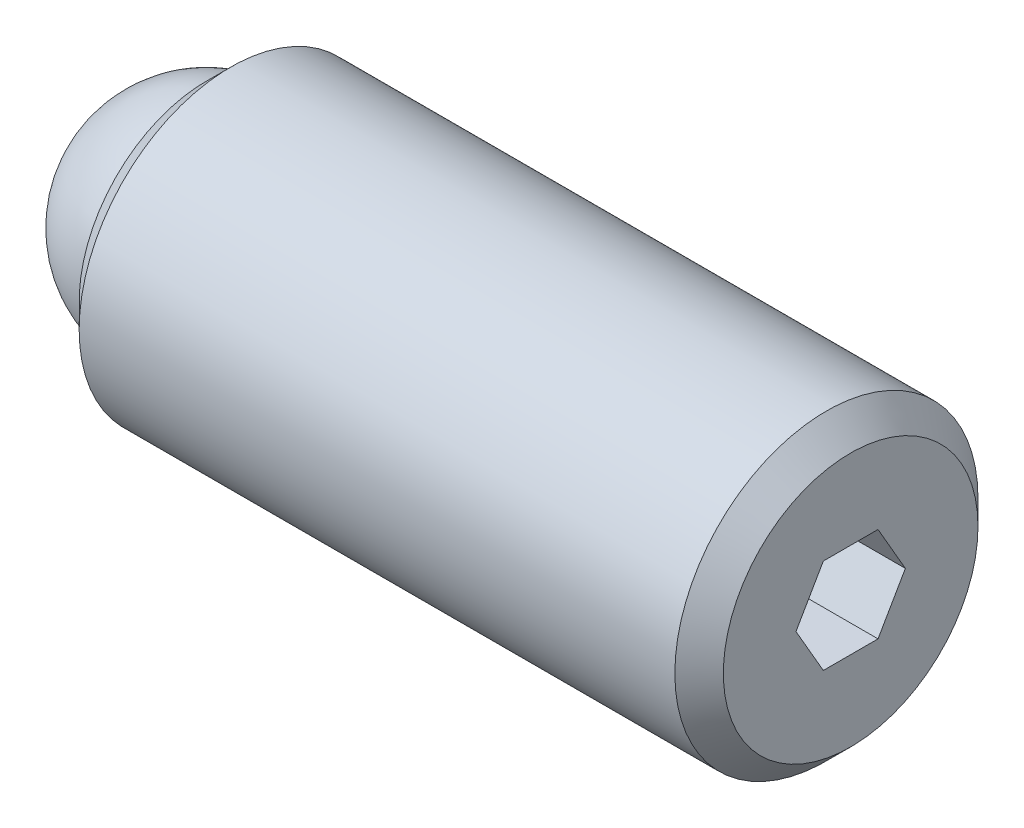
from build123d import *

# Parameters (mm, degrees)
SKETCH2_R           = 3.175
BOSS_EXTRUDE1_DEPTH = 13.49375
CHAMFER1_SIZE       = 0.508
CHAMFER2_SIZE       = 0.508
CUT_EXTRUDE2_DEPTH  = 2.286
SKETCH3_R           = 2.38125
CUT_EXTRUDE3_DEPTH  = 1.984375


with BuildPart() as part:
    # Sketch2 → Boss-Extrude1 (new body)
    with BuildSketch(Plane(origin=(0, 0, 0), x_dir=(0, 0, -1), z_dir=(1, 0, 0))):
        Circle(SKETCH2_R)
    extrude(amount=BOSS_EXTRUDE1_DEPTH)

    # Chamfer1
    chamfer1_edges = [part.edges().sort_by_distance(p)[0] for p in [
        (0, 0, 3.175),
    ]]
    chamfer(chamfer1_edges, length=CHAMFER1_SIZE)

    # Chamfer2
    chamfer2_edges = [part.edges().sort_by_distance(p)[0] for p in [
        (13.49375, 0, 3.175),
    ]]
    chamfer(chamfer2_edges, length=CHAMFER2_SIZE)

    # Sketch4 → Cut-Extrude2 (cut)
    with BuildSketch(Plane(origin=(13.49375, 0, 0), x_dir=(0, 0, -1), z_dir=(1, 0, 0))):
        Polygon((1.14567944, 0), (0.57283972, 0.9921875), (-0.57283972, 0.9921875), (-1.14567944, 0), (-0.57283972, -0.9921875), (0.57283972, -0.9921875), align=None)
    extrude(amount=-CUT_EXTRUDE2_DEPTH, mode=Mode.SUBTRACT)

    # Sketch3 → Cut-Extrude3 (cut)
    with BuildSketch(Plane.ZY):
        Circle(SKETCH3_R)
    extrude(amount=-CUT_EXTRUDE3_DEPTH, mode=Mode.SUBTRACT)


with BuildPart() as body_2:
    # Sketch5 → Revolve1 (revolve)
    with BuildSketch(Plane.ZY):
        with BuildLine():
            Line((0, 0), (0, -2.38125))
            ThreePointArc((0, -2.38125), (-2.38125, 0), (0, 2.38125))
            Line((0, 2.38125), (0, 0))
        make_face()
    revolve(axis=Axis((0, 0, 0), (0, 1, 0)))


solid = Compound([part.part, body_2.part])
